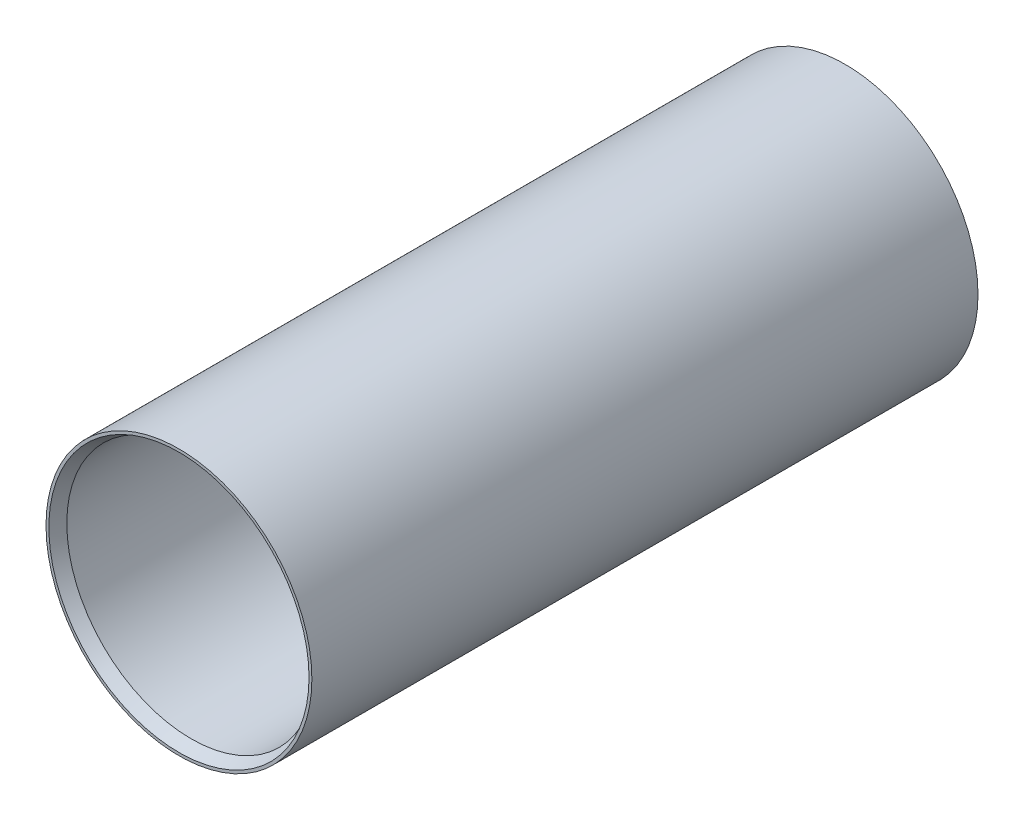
from build123d import *

# Parameters (mm, degrees)
SKIZZE1_R                    = 69.85
SKIZZE1_R_2                  = 65.35
BASIS_LINEAR_AUSTRAGEN_DEPTH = 350
FASE1_SIZE                   = 3
FASE1_SIZE2                  = 6.433520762


with BuildPart() as part:
    # Skizze1 → Basis-Linear austragen (new body)
    with BuildSketch(Plane.XY):
        Circle(SKIZZE1_R)
        Circle(SKIZZE1_R_2, mode=Mode.SUBTRACT)
    extrude(amount=BASIS_LINEAR_AUSTRAGEN_DEPTH)

    # Fase1
    fase1_edges = [part.edges().sort_by_distance(p)[0] for p in [
        (-65.35, 0, 350),
    ]]
    fase1_side = [part.faces().sort_by_distance(p)[0] for p in [
        (-67.874343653, 0, 350),
    ]]
    chamfer(fase1_edges, length=FASE1_SIZE, length2=FASE1_SIZE2, reference=fase1_side[0])


solid = part.part
